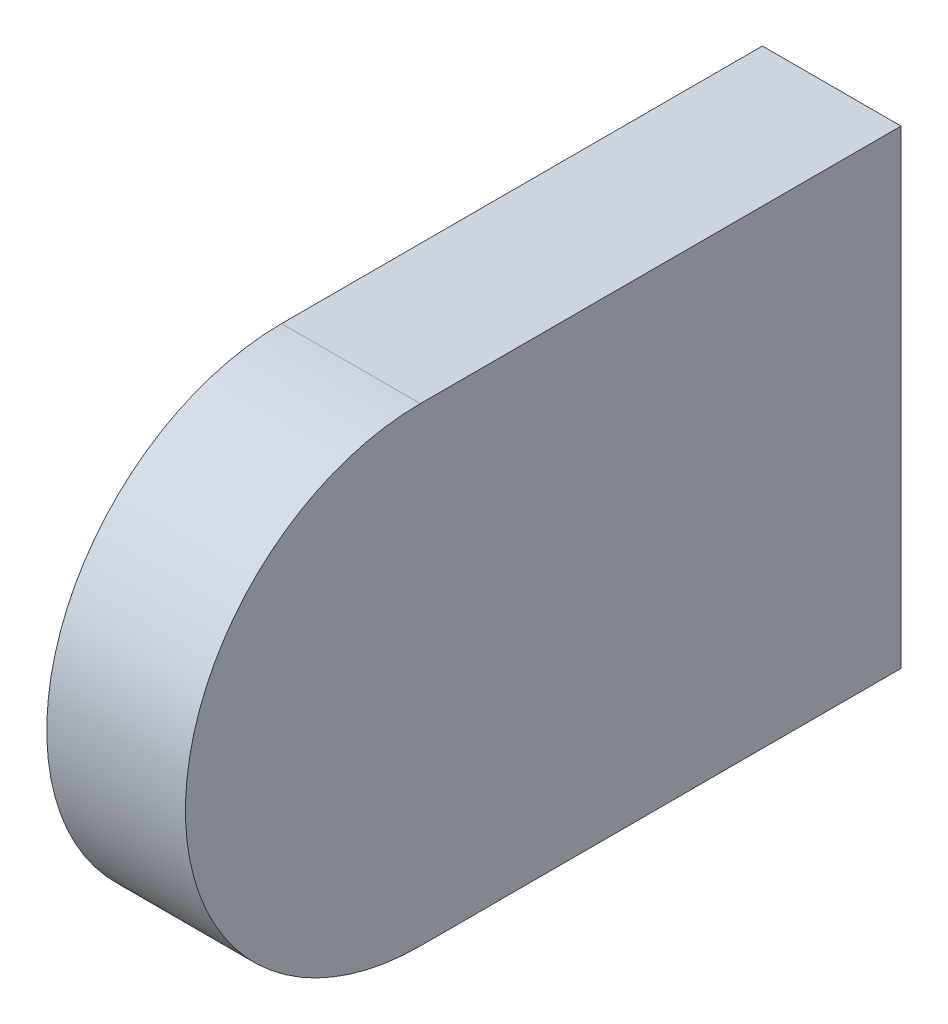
from build123d import *

# Parameters (mm, degrees)
BOSS_EXTRUDE1_DEPTH = 75


with BuildPart() as part:
    # Sketch1 → Boss-Extrude1 (new body)
    with BuildSketch(Plane.YZ):
        with BuildLine():
            Line((-127, 0), (-127, -260))
            Line((-127, -260), (127, -260))
            Line((127, -260), (127, 0))
            ThreePointArc((127, 0), (0, 127), (-127, 0))
        make_face()
    extrude(amount=BOSS_EXTRUDE1_DEPTH)


solid = part.part
